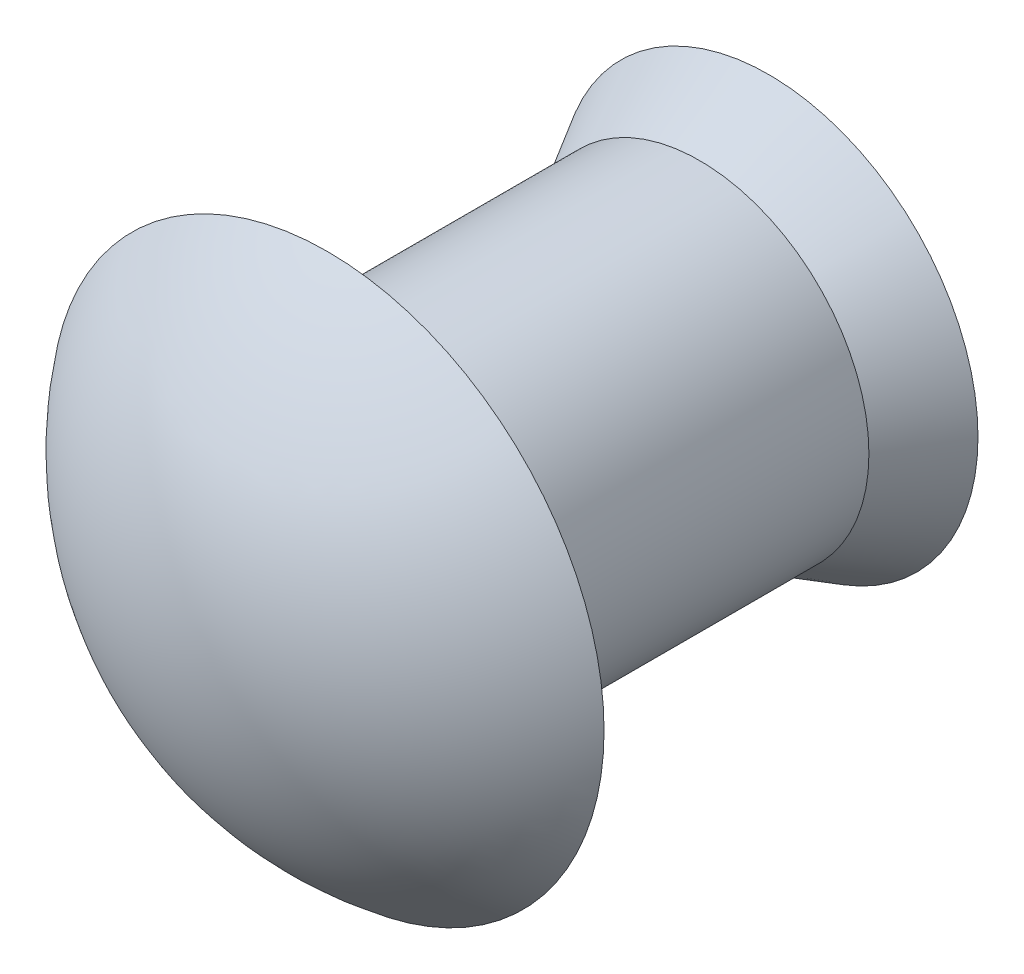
ISO-10303-21;
HEADER;
FILE_DESCRIPTION(('STEP AP214'),'2;1');
FILE_NAME('part.step','',(''),(''),'','','');
FILE_SCHEMA(('AUTOMOTIVE_DESIGN { 1 0 10303 214 1 1 1 1 }'));
ENDSEC;
DATA;
#1=APPLICATION_CONTEXT('core data for automotive mechanical design processes');
#2=APPLICATION_PROTOCOL_DEFINITION('international standard','automotive_design',2000,#1);
#3=PRODUCT_CONTEXT('',#1,'mechanical');
#4=PRODUCT('Part','Part','',(#3));
#5=PRODUCT_RELATED_PRODUCT_CATEGORY('part','',(#4));
#6=PRODUCT_DEFINITION_FORMATION('','',#4);
#7=PRODUCT_DEFINITION_CONTEXT('part definition',#1,'design');
#8=PRODUCT_DEFINITION('design','',#6,#7);
#9=PRODUCT_DEFINITION_SHAPE('','',#8);
#10=(LENGTH_UNIT() NAMED_UNIT(*) SI_UNIT(.MILLI.,.METRE.));
#11=(NAMED_UNIT(*) PLANE_ANGLE_UNIT() SI_UNIT($,.RADIAN.));
#12=(NAMED_UNIT(*) SI_UNIT($,.STERADIAN.) SOLID_ANGLE_UNIT());
#13=UNCERTAINTY_MEASURE_WITH_UNIT(LENGTH_MEASURE(1.E-05),#10,'distance_accuracy_value','');
#14=(GEOMETRIC_REPRESENTATION_CONTEXT(3) GLOBAL_UNCERTAINTY_ASSIGNED_CONTEXT((#13)) GLOBAL_UNIT_ASSIGNED_CONTEXT((#10,
#11,#12)) REPRESENTATION_CONTEXT('',''));
#15=CARTESIAN_POINT('',(0.,0.,0.));
#16=DIRECTION('',(0.,0.,1.));
#17=DIRECTION('',(1.,0.,0.));
#18=AXIS2_PLACEMENT_3D('',#15,#16,#17);
#19=CARTESIAN_POINT('',(0.,0.,-3.96875));
#20=DIRECTION('',(0.,0.,1.));
#21=DIRECTION('',(0.,1.,0.));
#22=AXIS2_PLACEMENT_3D('',#19,#20,#21);
#23=SPHERICAL_SURFACE('',#22,3.96875);
#24=CARTESIAN_POINT('',(0.,0.,-1.5875));
#25=DIRECTION('',(0.,0.,1.));
#26=DIRECTION('',(1.,0.,0.));
#27=AXIS2_PLACEMENT_3D('',#24,#25,#26);
#28=CIRCLE('',#27,3.175);
#29=CARTESIAN_POINT('',(3.175,0.,-1.5875));
#30=VERTEX_POINT('',#29);
#31=EDGE_CURVE('E10',#30,#30,#28,.T.);
#32=ORIENTED_EDGE('',*,*,#31,.T.);
#33=EDGE_LOOP('',(#32));
#34=FACE_BOUND('',#33,.T.);
#35=ADVANCED_FACE('F35',(#34),#23,.T.);
#36=CARTESIAN_POINT('',(0.,3.175,-1.5875));
#37=DIRECTION('',(0.,0.,1.));
#38=DIRECTION('',(1.,0.,0.));
#39=AXIS2_PLACEMENT_3D('',#36,#37,#38);
#40=PLANE('',#39);
#41=ORIENTED_EDGE('',*,*,#31,.F.);
#42=EDGE_LOOP('',(#41));
#43=FACE_BOUND('',#42,.T.);
#44=CARTESIAN_POINT('',(0.,0.,-1.5875));
#45=DIRECTION('',(0.,0.,1.));
#46=DIRECTION('',(1.,0.,0.));
#47=AXIS2_PLACEMENT_3D('',#44,#45,#46);
#48=CIRCLE('',#47,1.9431);
#49=CARTESIAN_POINT('',(1.9431,0.,-1.5875));
#50=VERTEX_POINT('',#49);
#51=EDGE_CURVE('E41',#50,#50,#48,.T.);
#52=ORIENTED_EDGE('',*,*,#51,.T.);
#53=EDGE_LOOP('',(#52));
#54=FACE_BOUND('',#53,.T.);
#55=ADVANCED_FACE('F67',(#43,#54),#40,.F.);
#56=CARTESIAN_POINT('',(0.,0.,0.));
#57=DIRECTION('',(0.,0.,1.));
#58=DIRECTION('',(1.,0.,0.));
#59=AXIS2_PLACEMENT_3D('',#56,#57,#58);
#60=CYLINDRICAL_SURFACE('',#59,1.9431);
#61=ORIENTED_EDGE('',*,*,#51,.F.);
#62=EDGE_LOOP('',(#61));
#63=FACE_BOUND('',#62,.T.);
#64=CARTESIAN_POINT('',(0.,0.,-5.85978));
#65=DIRECTION('',(0.,0.,1.));
#66=DIRECTION('',(1.,0.,0.));
#67=AXIS2_PLACEMENT_3D('',#64,#65,#66);
#68=CIRCLE('',#67,1.9431);
#69=CARTESIAN_POINT('',(1.9431,0.,-5.85978));
#70=VERTEX_POINT('',#69);
#71=EDGE_CURVE('E45',#70,#70,#68,.T.);
#72=ORIENTED_EDGE('',*,*,#71,.T.);
#73=EDGE_LOOP('',(#72));
#74=FACE_BOUND('',#73,.T.);
#75=ADVANCED_FACE('F63',(#63,#74),#60,.T.);
#76=CARTESIAN_POINT('',(0.,0.,-6.65353));
#77=DIRECTION('',(0.,0.,-1.));
#78=DIRECTION('',(-1.,0.,0.));
#79=AXIS2_PLACEMENT_3D('',#76,#77,#78);
#80=CONICAL_SURFACE('',#79,2.40137177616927,0.523598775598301);
#81=ORIENTED_EDGE('',*,*,#71,.F.);
#82=EDGE_LOOP('',(#81));
#83=FACE_BOUND('',#82,.T.);
#84=CARTESIAN_POINT('',(0.,0.,-6.65353));
#85=DIRECTION('',(0.,0.,1.));
#86=DIRECTION('',(1.,0.,0.));
#87=AXIS2_PLACEMENT_3D('',#84,#85,#86);
#88=CIRCLE('',#87,2.40137177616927);
#89=CARTESIAN_POINT('',(2.40137177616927,0.,-6.65353));
#90=VERTEX_POINT('',#89);
#91=EDGE_CURVE('E49',#90,#90,#88,.T.);
#92=ORIENTED_EDGE('',*,*,#91,.T.);
#93=EDGE_LOOP('',(#92));
#94=FACE_BOUND('',#93,.T.);
#95=ADVANCED_FACE('F55',(#83,#94),#80,.T.);
#96=CARTESIAN_POINT('',(0.,2.40137177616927,-6.65353));
#97=DIRECTION('',(0.,0.,1.));
#98=DIRECTION('',(1.,0.,0.));
#99=AXIS2_PLACEMENT_3D('',#96,#97,#98);
#100=PLANE('',#99);
#101=ORIENTED_EDGE('',*,*,#91,.F.);
#102=EDGE_LOOP('',(#101));
#103=FACE_BOUND('',#102,.T.);
#104=ADVANCED_FACE('F57',(#103),#100,.F.);
#105=CLOSED_SHELL('',(#35,#55,#75,#95,#104));
#106=MANIFOLD_SOLID_BREP('B2',#105);
#107=ADVANCED_BREP_SHAPE_REPRESENTATION('',(#18,#106),#14);
#108=SHAPE_DEFINITION_REPRESENTATION(#9,#107);
ENDSEC;
END-ISO-10303-21;
